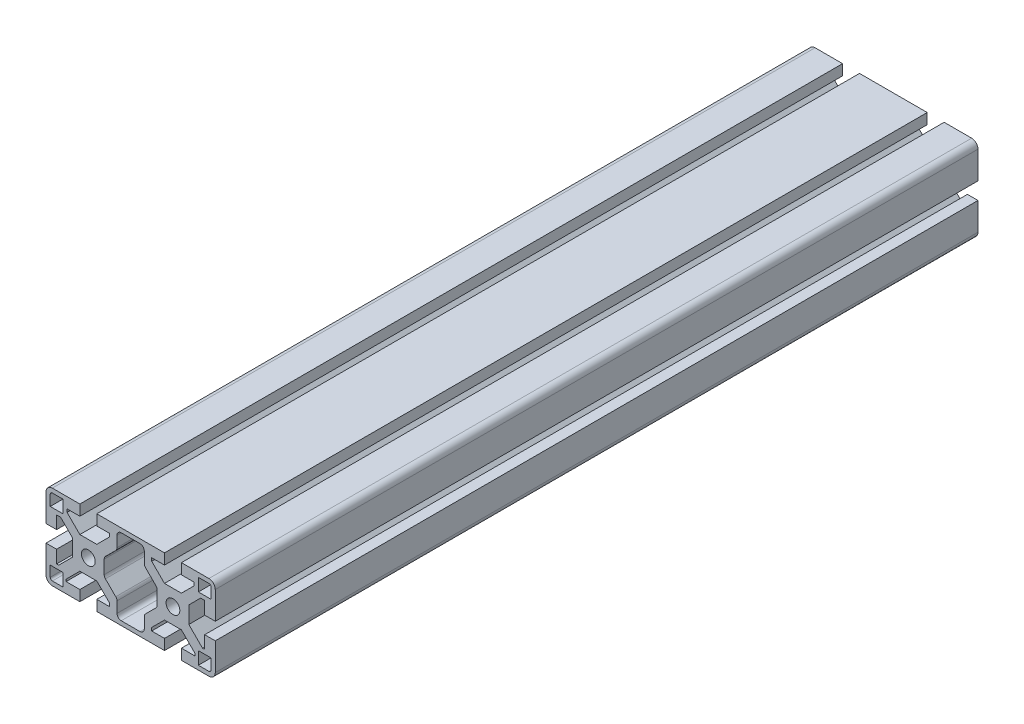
from build123d import *

# Parameters (mm, degrees)
CROQUIS1_R     = 3.25
EXTRUIR5_DEPTH = 360.5


with BuildPart() as part:
    # Croquis1 → Extruir5 (new body)
    with BuildSketch(Plane.XY):
        with BuildLine():
            Line((50.062875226, 13.55), (50.062875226, 15))
            Line((50.062875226, 15), (44, 15))
            Line((44, 15), (44, 20))
            Line((44, 20), (57, 20))
            ThreePointArc((57, 20), (59.121320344, 19.121320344), (60, 17))
            Line((60, 17), (60, 4))
            Line((60, 4), (55, 4))
            Line((55, 4), (55, 10.05))
            Line((55, 10.05), (53.1, 10.05))
            Line((53.1, 10.05), (47.5, 4.45))
            Line((47.5, 4.45), (47.5, -3.55))
            Line((47.5, -3.55), (54, -10.05))
            Line((54, -10.05), (55, -10.05))
            Line((55, -10.05), (55, -4))
            Line((55, -4), (60, -4))
            Line((60, -4), (60, -17))
            ThreePointArc((60, -17), (59.121320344, -19.121320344), (57, -20))
            Line((57, -20), (44, -20))
            Line((44, -20), (44, -15))
            Line((44, -15), (50.5, -15))
            Line((50.5, -15), (50.5, -14))
            Line((50.5, -14), (44, -7.5))
            Line((44, -7.5), (36, -7.5))
            Line((36, -7.5), (29.95, -13.55))
            Line((29.95, -13.55), (29.95, -15))
            Line((29.95, -15), (36, -15))
            Line((36, -15), (36, -20))
            Line((36, -20), (4, -20))
            Line((4, -20), (4, -15))
            Line((4, -15), (10.05, -15))
            Line((10.05, -15), (10.05, -13.55))
            Line((10.05, -13.55), (4, -7.5))
            Line((4, -7.5), (-4, -7.5))
            Line((-4, -7.5), (-10.5, -14))
            Line((-10.5, -14), (-10.5, -15))
            Line((-10.5, -15), (-4, -15))
            Line((-4, -15), (-4, -20))
            Line((-4, -20), (-17, -20))
            ThreePointArc((-17, -20), (-19.121320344, -19.121320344), (-20, -17))
            Line((-20, -17), (-20, -4))
            Line((-20, -4), (-15, -4))
            Line((-15, -4), (-15, -10.05))
            Line((-15, -10.05), (-14, -10.05))
            Line((-14, -10.05), (-7.5, -3.55))
            Line((-7.5, -3.55), (-7.5, 4.45))
            Line((-7.5, 4.45), (-13.1, 10.05))
            Line((-13.1, 10.05), (-15, 10.05))
            Line((-15, 10.05), (-15, 4))
            Line((-15, 4), (-20, 4))
            Line((-20, 4), (-20, 17))
            ThreePointArc((-20, 17), (-19.121320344, 19.121320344), (-17, 20))
            Line((-17, 20), (-4, 20))
            Line((-4, 20), (-4, 15))
            Line((-4, 15), (-10.062875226, 15))
            Line((-10.062875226, 15), (-10.062875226, 13.55))
            Line((-10.062875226, 13.55), (-4, 7.5))
            Line((-4, 7.5), (4, 7.5))
            Line((4, 7.5), (10.05, 13.55))
            Line((10.05, 13.55), (10.05, 15))
            Line((10.05, 15), (4, 15))
            Line((4, 15), (4, 20))
            Line((4, 20), (36, 20))
            Line((36, 20), (36, 15))
            Line((36, 15), (29.95, 15))
            Line((29.95, 15), (29.95, 13.55))
            Line((29.95, 13.55), (36, 7.5))
            Line((36, 7.5), (44, 7.5))
            Line((44, 7.5), (50.062875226, 13.55))
        make_face()
        Circle(CROQUIS1_R, mode=Mode.SUBTRACT)
        with Locations(Location((40, 0, 0), (0, 0, 180))):
            Circle(CROQUIS1_R, mode=Mode.SUBTRACT)
        with BuildLine():
            Line((-18, 12), (-12, 12))
            Line((-12, 12), (-12, 18))
            Line((-12, 18), (-17, 18))
            ThreePointArc((-17, 18), (-17.707106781, 17.707106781), (-18, 17))
            Line((-18, 17), (-18, 12))
        make_face(mode=Mode.SUBTRACT)
        with BuildLine():
            Line((24.45, 18), (15.55, 18))
            ThreePointArc((15.55, 18), (14.135786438, 17.414213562), (13.55, 16))
            Line((13.55, 16), (13.55, 10.878427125))
            ThreePointArc((13.55, 10.878427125), (13.397759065, 10.11306026), (12.964213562, 9.464213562))
            Line((12.964213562, 9.464213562), (8.085786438, 4.585786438))
            ThreePointArc((8.085786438, 4.585786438), (7.652240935, 3.93693974), (7.5, 3.171572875))
            Line((7.5, 3.171572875), (7.5, -3.171572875))
            ThreePointArc((7.5, -3.171572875), (7.652240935, -3.93693974), (8.085786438, -4.585786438))
            Line((8.085786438, -4.585786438), (12.964213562, -9.464213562))
            ThreePointArc((12.964213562, -9.464213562), (13.397759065, -10.11306026), (13.55, -10.878427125))
            Line((13.55, -10.878427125), (13.55, -16))
            ThreePointArc((13.55, -16), (14.135786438, -17.414213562), (15.55, -18))
            Line((15.55, -18), (24.45, -18))
            ThreePointArc((24.45, -18), (25.864213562, -17.414213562), (26.45, -16))
            Line((26.45, -16), (26.45, -10.878427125))
            ThreePointArc((26.45, -10.878427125), (26.602240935, -10.11306026), (27.035786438, -9.464213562))
            Line((27.035786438, -9.464213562), (31.914213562, -4.585786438))
            ThreePointArc((31.914213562, -4.585786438), (32.347759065, -3.93693974), (32.5, -3.171572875))
            Line((32.5, -3.171572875), (32.5, 3.171572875))
            ThreePointArc((32.5, 3.171572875), (32.347759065, 3.93693974), (31.914213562, 4.585786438))
            Line((31.914213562, 4.585786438), (27.035786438, 9.464213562))
            ThreePointArc((27.035786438, 9.464213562), (26.602240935, 10.11306026), (26.45, 10.878427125))
            Line((26.45, 10.878427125), (26.45, 16))
            ThreePointArc((26.45, 16), (25.864213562, 17.414213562), (24.45, 18))
        make_face(mode=Mode.SUBTRACT)
        with BuildLine():
            Line((-17, -18), (-12, -18))
            Line((-12, -18), (-12, -12))
            Line((-12, -12), (-18, -12))
            Line((-18, -12), (-18, -17))
            ThreePointArc((-18, -17), (-17.707106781, -17.707106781), (-17, -18))
        make_face(mode=Mode.SUBTRACT)
        with BuildLine():
            Line((58, -17), (58, -12))
            Line((58, -12), (52, -12))
            Line((52, -12), (52, -18))
            Line((52, -18), (57, -18))
            ThreePointArc((57, -18), (57.707106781, -17.707106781), (58, -17))
        make_face(mode=Mode.SUBTRACT)
        with BuildLine():
            Line((58, 12), (58, 17))
            ThreePointArc((58, 17), (57.707106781, 17.707106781), (57, 18))
            Line((57, 18), (52, 18))
            Line((52, 18), (52, 12))
            Line((52, 12), (58, 12))
        make_face(mode=Mode.SUBTRACT)
    extrude(amount=EXTRUIR5_DEPTH)


solid = part.part
